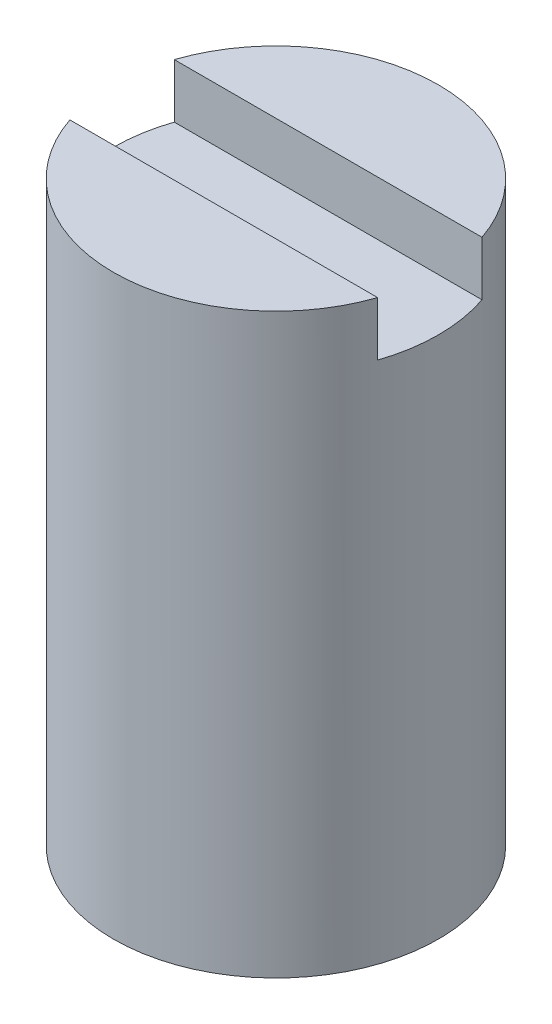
ISO-10303-21;
HEADER;
FILE_DESCRIPTION(('STEP AP214'),'2;1');
FILE_NAME('part.step','',(''),(''),'','','');
FILE_SCHEMA(('AUTOMOTIVE_DESIGN { 1 0 10303 214 1 1 1 1 }'));
ENDSEC;
DATA;
#1=APPLICATION_CONTEXT('core data for automotive mechanical design processes');
#2=APPLICATION_PROTOCOL_DEFINITION('international standard','automotive_design',2000,#1);
#3=PRODUCT_CONTEXT('',#1,'mechanical');
#4=PRODUCT('Part','Part','',(#3));
#5=PRODUCT_RELATED_PRODUCT_CATEGORY('part','',(#4));
#6=PRODUCT_DEFINITION_FORMATION('','',#4);
#7=PRODUCT_DEFINITION_CONTEXT('part definition',#1,'design');
#8=PRODUCT_DEFINITION('design','',#6,#7);
#9=PRODUCT_DEFINITION_SHAPE('','',#8);
#10=(LENGTH_UNIT() NAMED_UNIT(*) SI_UNIT(.MILLI.,.METRE.));
#11=(NAMED_UNIT(*) PLANE_ANGLE_UNIT() SI_UNIT($,.RADIAN.));
#12=(NAMED_UNIT(*) SI_UNIT($,.STERADIAN.) SOLID_ANGLE_UNIT());
#13=UNCERTAINTY_MEASURE_WITH_UNIT(LENGTH_MEASURE(1.E-05),#10,'distance_accuracy_value','');
#14=(GEOMETRIC_REPRESENTATION_CONTEXT(3) GLOBAL_UNCERTAINTY_ASSIGNED_CONTEXT((#13)) GLOBAL_UNIT_ASSIGNED_CONTEXT((#10,
#11,#12)) REPRESENTATION_CONTEXT('',''));
#15=CARTESIAN_POINT('',(0.,0.,0.));
#16=DIRECTION('',(0.,0.,1.));
#17=DIRECTION('',(1.,0.,0.));
#18=AXIS2_PLACEMENT_3D('',#15,#16,#17);
#19=CARTESIAN_POINT('',(0.,33.854898,0.));
#20=DIRECTION('',(0.,1.,0.));
#21=DIRECTION('',(0.,0.,1.));
#22=AXIS2_PLACEMENT_3D('',#19,#20,#21);
#23=PLANE('',#22);
#24=DIRECTION('',(1.,0.,0.));
#25=VECTOR('',#24,1.);
#26=CARTESIAN_POINT('',(0.,33.854898,3.0607));
#27=LINE('',#26,#25);
#28=CARTESIAN_POINT('',(-9.0198525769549,33.854898,3.0607));
#29=VERTEX_POINT('',#28);
#30=CARTESIAN_POINT('',(9.0198525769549,33.854898,3.0607));
#31=VERTEX_POINT('',#30);
#32=EDGE_CURVE('E121',#29,#31,#27,.T.);
#33=ORIENTED_EDGE('',*,*,#32,.F.);
#34=CARTESIAN_POINT('',(0.,33.854898,0.));
#35=DIRECTION('',(0.,1.,0.));
#36=DIRECTION('',(0.,0.,1.));
#37=AXIS2_PLACEMENT_3D('',#34,#35,#36);
#38=CIRCLE('',#37,9.525);
#39=EDGE_CURVE('E114',#29,#31,#38,.T.);
#40=ORIENTED_EDGE('',*,*,#39,.T.);
#41=EDGE_LOOP('',(#33,#40));
#42=FACE_BOUND('',#41,.T.);
#43=ADVANCED_FACE('F41',(#42),#23,.T.);
#44=CARTESIAN_POINT('',(0.,33.854898,0.));
#45=DIRECTION('',(0.,-1.,0.));
#46=DIRECTION('',(0.,0.,-1.));
#47=AXIS2_PLACEMENT_3D('',#44,#45,#46);
#48=CYLINDRICAL_SURFACE('',#47,9.525);
#49=CARTESIAN_POINT('',(0.,30.679898,0.));
#50=DIRECTION('',(0.,-1.,0.));
#51=DIRECTION('',(0.,0.,-1.));
#52=AXIS2_PLACEMENT_3D('',#49,#50,#51);
#53=CIRCLE('',#52,9.525);
#54=CARTESIAN_POINT('',(9.0198525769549,30.679898,-3.0607));
#55=VERTEX_POINT('',#54);
#56=CARTESIAN_POINT('',(9.0198525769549,30.679898,3.0607));
#57=VERTEX_POINT('',#56);
#58=EDGE_CURVE('E11',#55,#57,#53,.T.);
#59=ORIENTED_EDGE('',*,*,#58,.T.);
#60=DIRECTION('',(0.,-1.,0.));
#61=VECTOR('',#60,1.);
#62=CARTESIAN_POINT('',(9.0198525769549,33.854898,3.0607));
#63=LINE('',#62,#61);
#64=EDGE_CURVE('E64',#57,#31,#63,.F.);
#65=ORIENTED_EDGE('',*,*,#64,.T.);
#66=ORIENTED_EDGE('',*,*,#39,.F.);
#67=DIRECTION('',(0.,-1.,0.));
#68=VECTOR('',#67,1.);
#69=CARTESIAN_POINT('',(-9.0198525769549,33.854898,3.0607));
#70=LINE('',#69,#68);
#71=CARTESIAN_POINT('',(-9.0198525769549,30.679898,3.0607));
#72=VERTEX_POINT('',#71);
#73=EDGE_CURVE('E110',#29,#72,#70,.T.);
#74=ORIENTED_EDGE('',*,*,#73,.T.);
#75=CARTESIAN_POINT('',(-9.0198525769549,30.679898,-3.0607));
#76=VERTEX_POINT('',#75);
#77=EDGE_CURVE('E45',#72,#76,#53,.T.);
#78=ORIENTED_EDGE('',*,*,#77,.T.);
#79=DIRECTION('',(0.,-1.,0.));
#80=VECTOR('',#79,1.);
#81=CARTESIAN_POINT('',(-9.0198525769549,33.854898,-3.0607));
#82=LINE('',#81,#80);
#83=CARTESIAN_POINT('',(-9.0198525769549,33.854898,-3.0607));
#84=VERTEX_POINT('',#83);
#85=EDGE_CURVE('E105',#76,#84,#82,.F.);
#86=ORIENTED_EDGE('',*,*,#85,.T.);
#87=CARTESIAN_POINT('',(9.0198525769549,33.854898,-3.0607));
#88=VERTEX_POINT('',#87);
#89=EDGE_CURVE('E117',#88,#84,#38,.T.);
#90=ORIENTED_EDGE('',*,*,#89,.F.);
#91=DIRECTION('',(0.,-1.,0.));
#92=VECTOR('',#91,1.);
#93=CARTESIAN_POINT('',(9.0198525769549,33.854898,-3.0607));
#94=LINE('',#93,#92);
#95=EDGE_CURVE('E56',#88,#55,#94,.T.);
#96=ORIENTED_EDGE('',*,*,#95,.T.);
#97=EDGE_LOOP('',(#59,#65,#66,#74,#78,#86,#90,#96));
#98=FACE_BOUND('',#97,.T.);
#99=CARTESIAN_POINT('',(0.,0.,0.));
#100=DIRECTION('',(0.,1.,0.));
#101=DIRECTION('',(0.,0.,1.));
#102=AXIS2_PLACEMENT_3D('',#99,#100,#101);
#103=CIRCLE('',#102,9.525);
#104=CARTESIAN_POINT('',(0.,0.,9.525));
#105=VERTEX_POINT('',#104);
#106=EDGE_CURVE('E113',#105,#105,#103,.T.);
#107=ORIENTED_EDGE('',*,*,#106,.T.);
#108=EDGE_LOOP('',(#107));
#109=FACE_BOUND('',#108,.T.);
#110=ADVANCED_FACE('F43',(#98,#109),#48,.T.);
#111=DIRECTION('',(-1.,0.,0.));
#112=VECTOR('',#111,1.);
#113=CARTESIAN_POINT('',(0.,33.854898,-3.0607));
#114=LINE('',#113,#112);
#115=EDGE_CURVE('E120',#88,#84,#114,.T.);
#116=ORIENTED_EDGE('',*,*,#115,.F.);
#117=ORIENTED_EDGE('',*,*,#89,.T.);
#118=EDGE_LOOP('',(#116,#117));
#119=FACE_BOUND('',#118,.T.);
#120=ADVANCED_FACE('F134',(#119),#23,.T.);
#121=CARTESIAN_POINT('',(0.,0.,0.));
#122=DIRECTION('',(0.,1.,0.));
#123=DIRECTION('',(0.,0.,1.));
#124=AXIS2_PLACEMENT_3D('',#121,#122,#123);
#125=PLANE('',#124);
#126=CARTESIAN_POINT('',(0.,0.,0.));
#127=DIRECTION('',(0.,-1.,0.));
#128=DIRECTION('',(0.,0.,-1.));
#129=AXIS2_PLACEMENT_3D('',#126,#127,#128);
#130=CIRCLE('',#129,2.55269999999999);
#131=CARTESIAN_POINT('',(0.,0.,-2.55269999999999));
#132=VERTEX_POINT('',#131);
#133=EDGE_CURVE('E96',#132,#132,#130,.T.);
#134=ORIENTED_EDGE('',*,*,#133,.F.);
#135=EDGE_LOOP('',(#134));
#136=FACE_BOUND('',#135,.T.);
#137=ORIENTED_EDGE('',*,*,#106,.F.);
#138=EDGE_LOOP('',(#137));
#139=FACE_BOUND('',#138,.T.);
#140=ADVANCED_FACE('F136',(#136,#139),#125,.F.);
#141=CARTESIAN_POINT('',(0.,30.679898,0.));
#142=DIRECTION('',(0.,-1.,0.));
#143=DIRECTION('',(0.,0.,-1.));
#144=AXIS2_PLACEMENT_3D('',#141,#142,#143);
#145=PLANE('',#144);
#146=DIRECTION('',(-1.,0.,0.));
#147=VECTOR('',#146,1.);
#148=CARTESIAN_POINT('',(-12.7,30.679898,-3.0607));
#149=LINE('',#148,#147);
#150=EDGE_CURVE('E95',#55,#76,#149,.T.);
#151=ORIENTED_EDGE('',*,*,#150,.T.);
#152=ORIENTED_EDGE('',*,*,#77,.F.);
#153=DIRECTION('',(1.,0.,0.));
#154=VECTOR('',#153,1.);
#155=CARTESIAN_POINT('',(-12.7,30.679898,3.0607));
#156=LINE('',#155,#154);
#157=EDGE_CURVE('E99',#72,#57,#156,.T.);
#158=ORIENTED_EDGE('',*,*,#157,.T.);
#159=ORIENTED_EDGE('',*,*,#58,.F.);
#160=EDGE_LOOP('',(#151,#152,#158,#159));
#161=FACE_BOUND('',#160,.T.);
#162=ADVANCED_FACE('F130',(#161),#145,.F.);
#163=CARTESIAN_POINT('',(-12.7,30.679898,3.0607));
#164=DIRECTION('',(0.,0.,1.));
#165=DIRECTION('',(1.,0.,0.));
#166=AXIS2_PLACEMENT_3D('',#163,#164,#165);
#167=PLANE('',#166);
#168=ORIENTED_EDGE('',*,*,#32,.T.);
#169=ORIENTED_EDGE('',*,*,#64,.F.);
#170=ORIENTED_EDGE('',*,*,#157,.F.);
#171=ORIENTED_EDGE('',*,*,#73,.F.);
#172=EDGE_LOOP('',(#168,#169,#170,#171));
#173=FACE_BOUND('',#172,.T.);
#174=ADVANCED_FACE('F131',(#173),#167,.F.);
#175=CARTESIAN_POINT('',(-12.7,30.679898,-3.0607));
#176=DIRECTION('',(0.,0.,-1.));
#177=DIRECTION('',(-1.,0.,0.));
#178=AXIS2_PLACEMENT_3D('',#175,#176,#177);
#179=PLANE('',#178);
#180=ORIENTED_EDGE('',*,*,#115,.T.);
#181=ORIENTED_EDGE('',*,*,#85,.F.);
#182=ORIENTED_EDGE('',*,*,#150,.F.);
#183=ORIENTED_EDGE('',*,*,#95,.F.);
#184=EDGE_LOOP('',(#180,#181,#182,#183));
#185=FACE_BOUND('',#184,.T.);
#186=ADVANCED_FACE('F89',(#185),#179,.F.);
#187=CARTESIAN_POINT('',(0.,12.7,0.));
#188=DIRECTION('',(0.,-1.,0.));
#189=DIRECTION('',(0.,0.,-1.));
#190=AXIS2_PLACEMENT_3D('',#187,#188,#189);
#191=CONICAL_SURFACE('',#190,2.55269999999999,1.02974425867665);
#192=CARTESIAN_POINT('',(0.,14.2338169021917,0.));
#193=VERTEX_POINT('',#192);
#194=VERTEX_LOOP('',#193);
#195=FACE_BOUND('',#194,.T.);
#196=CARTESIAN_POINT('',(0.,12.7,0.));
#197=DIRECTION('',(0.,-1.,0.));
#198=DIRECTION('',(0.,0.,-1.));
#199=AXIS2_PLACEMENT_3D('',#196,#197,#198);
#200=CIRCLE('',#199,2.55269999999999);
#201=CARTESIAN_POINT('',(0.,12.7,-2.55269999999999));
#202=VERTEX_POINT('',#201);
#203=EDGE_CURVE('E93',#202,#202,#200,.T.);
#204=ORIENTED_EDGE('',*,*,#203,.T.);
#205=EDGE_LOOP('',(#204));
#206=FACE_BOUND('',#205,.T.);
#207=ADVANCED_FACE('F85',(#195,#206),#191,.F.);
#208=CARTESIAN_POINT('',(0.,0.,0.));
#209=DIRECTION('',(0.,-1.,0.));
#210=DIRECTION('',(0.,0.,-1.));
#211=AXIS2_PLACEMENT_3D('',#208,#209,#210);
#212=CYLINDRICAL_SURFACE('',#211,2.55269999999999);
#213=ORIENTED_EDGE('',*,*,#203,.F.);
#214=EDGE_LOOP('',(#213));
#215=FACE_BOUND('',#214,.T.);
#216=ORIENTED_EDGE('',*,*,#133,.T.);
#217=EDGE_LOOP('',(#216));
#218=FACE_BOUND('',#217,.T.);
#219=ADVANCED_FACE('F88',(#215,#218),#212,.F.);
#220=CLOSED_SHELL('',(#43,#110,#120,#140,#162,#174,#186,#207,#219));
#221=MANIFOLD_SOLID_BREP('B2',#220);
#222=ADVANCED_BREP_SHAPE_REPRESENTATION('',(#18,#221),#14);
#223=SHAPE_DEFINITION_REPRESENTATION(#9,#222);
ENDSEC;
END-ISO-10303-21;
